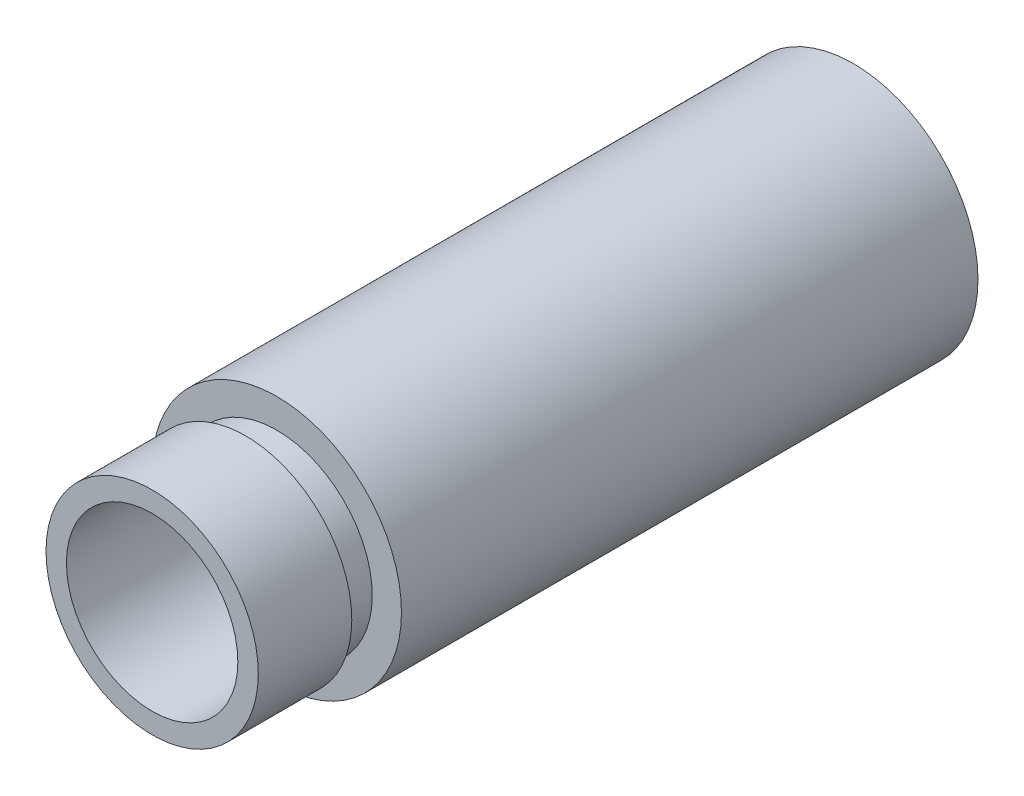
from build123d import *

# Parameters (mm, degrees)
ESQUISSE1_R             = 10
EXTRUSION1_DEPTH        = 45
ESQUISSE2_R             = 5.5
ENL_V_MAT_EXTRU_1_DEPTH = 42
ESQUISSE3_R             = 4
ENL_V_MAT_EXTRU_2_DEPTH = 45.317039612
ESQUISSE4_OUTSIDE_W     = 32.63
ESQUISSE4_OUTSIDE_H     = 32.63
ESQUISSE4_OUTSIDE_R     = 8
ENL_V_MAT_EXTRU_3_DEPTH = 48.16990566
ESQUISSE5_OUTSIDE_W     = 28.074
ESQUISSE5_OUTSIDE_H     = 28.074
ESQUISSE5_OUTSIDE_R     = 6.811875
ENL_V_MAT_EXTRU_4_DEPTH = 6
ESQUISSE6_OUTSIDE_W     = 28.074
ESQUISSE6_OUTSIDE_H     = 28.074
ESQUISSE6_OUTSIDE_R     = 6.125
ENL_V_MAT_EXTRU_5_DEPTH = 2


with BuildPart() as part:
    # Esquisse1 → Extrusion1 (new body)
    with BuildSketch(Plane.XY):
        Circle(ESQUISSE1_R)
    extrude(amount=EXTRUSION1_DEPTH)

    # Esquisse2 → Enl_v. mat.-Extru.1 (cut)
    with BuildSketch(Plane.XY.offset(45)):
        Circle(ESQUISSE2_R)
    extrude(amount=-ENL_V_MAT_EXTRU_1_DEPTH, mode=Mode.SUBTRACT)

    # Esquisse3 → Enl_v. mat.-Extru.2 (cut, through all)
    with BuildSketch(Plane.XY.offset(3)):
        Circle(ESQUISSE3_R)
    extrude(amount=-ENL_V_MAT_EXTRU_2_DEPTH, mode=Mode.SUBTRACT)

    # Esquisse4 outside → Enl_v. mat.-Extru.3 (cut, through all)
    with BuildSketch(Plane.XY.offset(45)):
        Rectangle(ESQUISSE4_OUTSIDE_W, ESQUISSE4_OUTSIDE_H)
        Circle(ESQUISSE4_OUTSIDE_R, mode=Mode.SUBTRACT)
    extrude(amount=-ENL_V_MAT_EXTRU_3_DEPTH, mode=Mode.SUBTRACT)

    # Esquisse5 outside → Enl_v. mat.-Extru.4 (cut)
    with BuildSketch(Plane.XY.offset(45)):
        Rectangle(ESQUISSE5_OUTSIDE_W, ESQUISSE5_OUTSIDE_H)
        Circle(ESQUISSE5_OUTSIDE_R, mode=Mode.SUBTRACT)
    extrude(amount=-ENL_V_MAT_EXTRU_4_DEPTH, mode=Mode.SUBTRACT)

    # Esquisse6 outside → Enl_v. mat.-Extru.5 (cut)
    with BuildSketch(Plane.XY.offset(39)):
        Rectangle(ESQUISSE6_OUTSIDE_W, ESQUISSE6_OUTSIDE_H)
        Circle(ESQUISSE6_OUTSIDE_R, mode=Mode.SUBTRACT)
    extrude(amount=-ENL_V_MAT_EXTRU_5_DEPTH, mode=Mode.SUBTRACT)


solid = part.part
